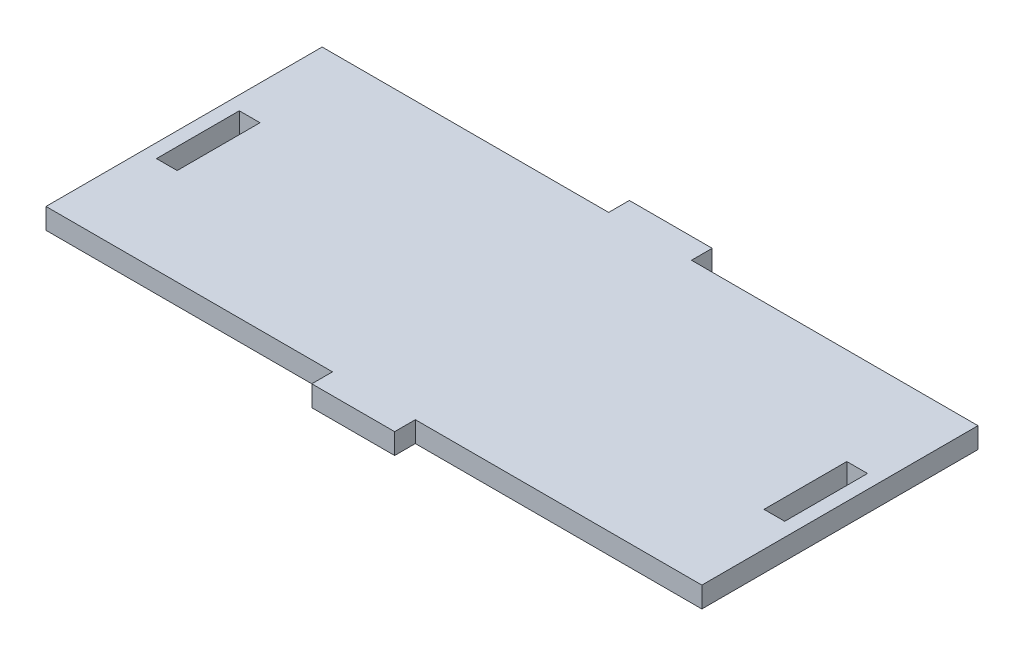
from build123d import *

# Parameters (mm, degrees)
SKETCH1_W           = 12
SKETCH1_H           = 3
SKETCH1_W_2         = 2
SKETCH1_H_2         = 40
BOSS_EXTRUDE1_DEPTH = 3


with BuildPart() as part:
    # Sketch1 → Boss-Extrude1 (new body)
    with BuildSketch(Plane(origin=(0, 0, 0), x_dir=(1, 0, 0), z_dir=(0, 1, 0))):
        Polygon((39.5, 0), (0, 0), (0, -14), (3, -14), (3, -26), (0, -26), (0, -40), (39.5, -40), (51.5, -40), (91, -40), (91, -26), (88, -26), (88, -14), (91, -14), (91, 0), (51.5, 0), align=None)
        with Locations((45.5, -41.5)):
            Rectangle(SKETCH1_W, SKETCH1_H)
        with Locations((-1, -20)):
            Rectangle(SKETCH1_W_2, SKETCH1_H_2)
        with Locations((45.5, 1.5)):
            Rectangle(SKETCH1_W, SKETCH1_H)
        with Locations((92, -20)):
            Rectangle(SKETCH1_W_2, SKETCH1_H_2)
    extrude(amount=BOSS_EXTRUDE1_DEPTH)


solid = part.part
